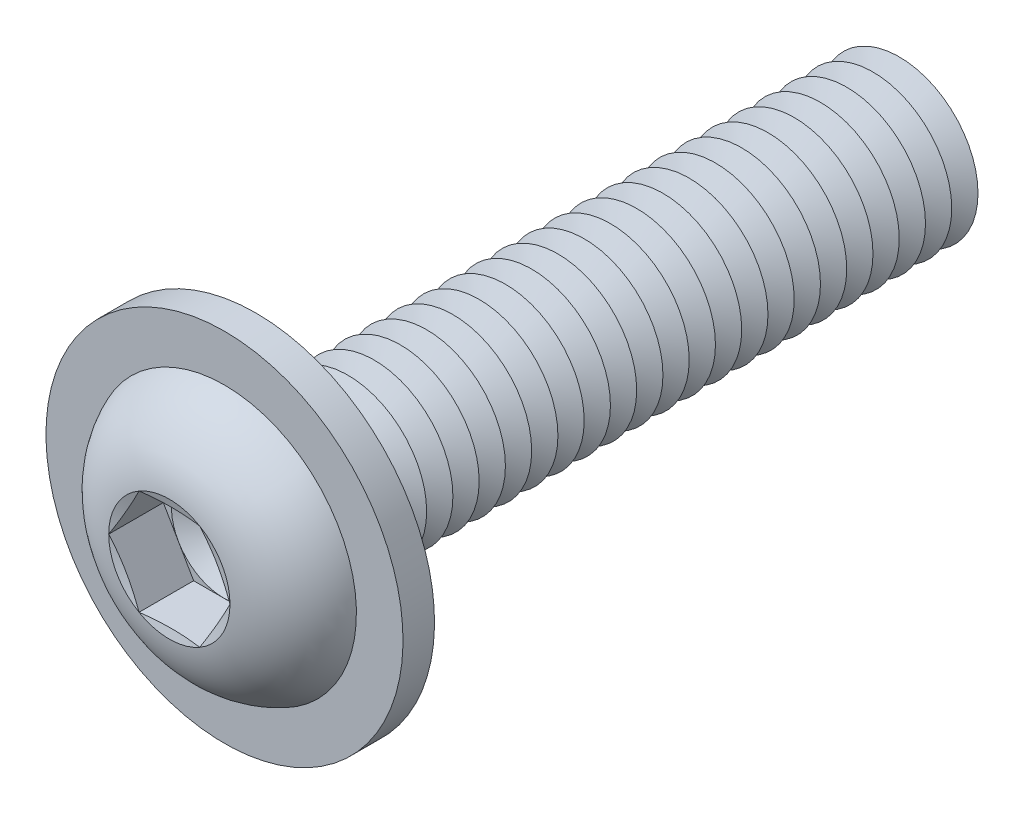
from build123d import *

# Parameters (mm, degrees)
FILLET1_R           = 0.5
LPATTERN1_COUNT     = 25
LPATTERN1_PITCH     = 1
CUT_EXTRUDE1_DEPTH  = 2.08
SKETCH5_R           = 6.8
SKETCH5_R_2         = 3.5
BOSS_EXTRUDE1_DEPTH = 1.2


with BuildPart() as part:
    # Sketch1 → Revolve1 (revolve)
    with BuildSketch(Plane(origin=(0, 0, 0), x_dir=(0, 0, -1), z_dir=(1, 0, 0)), mode=Mode.PRIVATE) as revolve1_sk:
        with BuildLine():
            Line((0, 3), (0, 5.25))
            ThreePointArc((0, 5.25), (-2.210041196, 4.408189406), (-3.3, 2.3094))
            Line((-3.3, 2.3094), (-2.990599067, 1.1547))
            Line((-2.990599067, 1.1547), (-3.3, 1.1547))
            Line((-3.3, 1.1547), (-3.3, 0))
            Line((-3.3, 0), (25, 0))
            Line((25, 0), (25, 3))
            Line((25, 3), (0, 3))
        make_face()
    revolve(revolve1_sk.sketch.rotate(Axis((0, 0, -25), (0, 0, 1)), 90), axis=Axis((0, 0, -25), (0, 0, 1)))

    # Fillet1
    fillet1_edges = [part.edges().sort_by_distance(p)[0] for p in [
        (3, 0, 0),
    ]]
    fillet(fillet1_edges, radius=FILLET1_R)

    # Sketch2 → Cut-Revolve1 (revolve, cut)
    with BuildSketch(Plane(origin=(0, 0, 0), x_dir=(0, 0, -1), z_dir=(1, 0, 0)), mode=Mode.PRIVATE) as cut_revolve1_sk:
        Polygon((24.5, 3), (25.5, 3), (25, 2.133974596), align=None)
    cut_revolve1 = revolve(cut_revolve1_sk.sketch.rotate(Axis((0, 0, -25), (0, 0, -1)), 270), axis=Axis((0, 0, -25), (0, 0, -1)), mode=Mode.SUBTRACT)

    # LPattern1: Cut-Revolve1 ×25
    with Locations(*[(0, 0, i * LPATTERN1_PITCH) for i in range(1, LPATTERN1_COUNT)]):
        add(cut_revolve1, mode=Mode.SUBTRACT)

    # Sketch3 → Cut-Extrude1 (cut)
    with BuildSketch(Plane.XY.offset(3.3)):
        Polygon((1.1547, 1.999999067), (-1.1547, 1.999999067), (-2.3094, 0), (-1.1547, -1.999999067), (1.1547, -1.999999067), (2.3094, 0), align=None)
    extrude(amount=-CUT_EXTRUDE1_DEPTH, mode=Mode.SUBTRACT)

    # Cut-Extrude2 cone 1 section (on through the dimple's axis) → Cut-Extrude2 (revolve, cut)
    with BuildSketch(Plane(origin=(0, 0, 1.22), x_dir=(0, -1, 0), z_dir=(1, 0, 0))):
        Polygon((0, 0), (1.999999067, 0), (0, 1.1547), align=None)
    revolve(axis=Axis((0, 0, 1.22), (0, 0, -1)), mode=Mode.SUBTRACT)

    # Sketch5 → Boss-Extrude1 (add)
    with BuildSketch(Plane(origin=(0, 0, 0), x_dir=(-1, 0, 0), z_dir=(0, 0, -1))):
        with Locations(Location((0, 0, 0), (0, 0, 90))):
            Circle(SKETCH5_R)
        Circle(SKETCH5_R_2, mode=Mode.SUBTRACT)
    extrude(amount=-BOSS_EXTRUDE1_DEPTH)


solid = part.part
